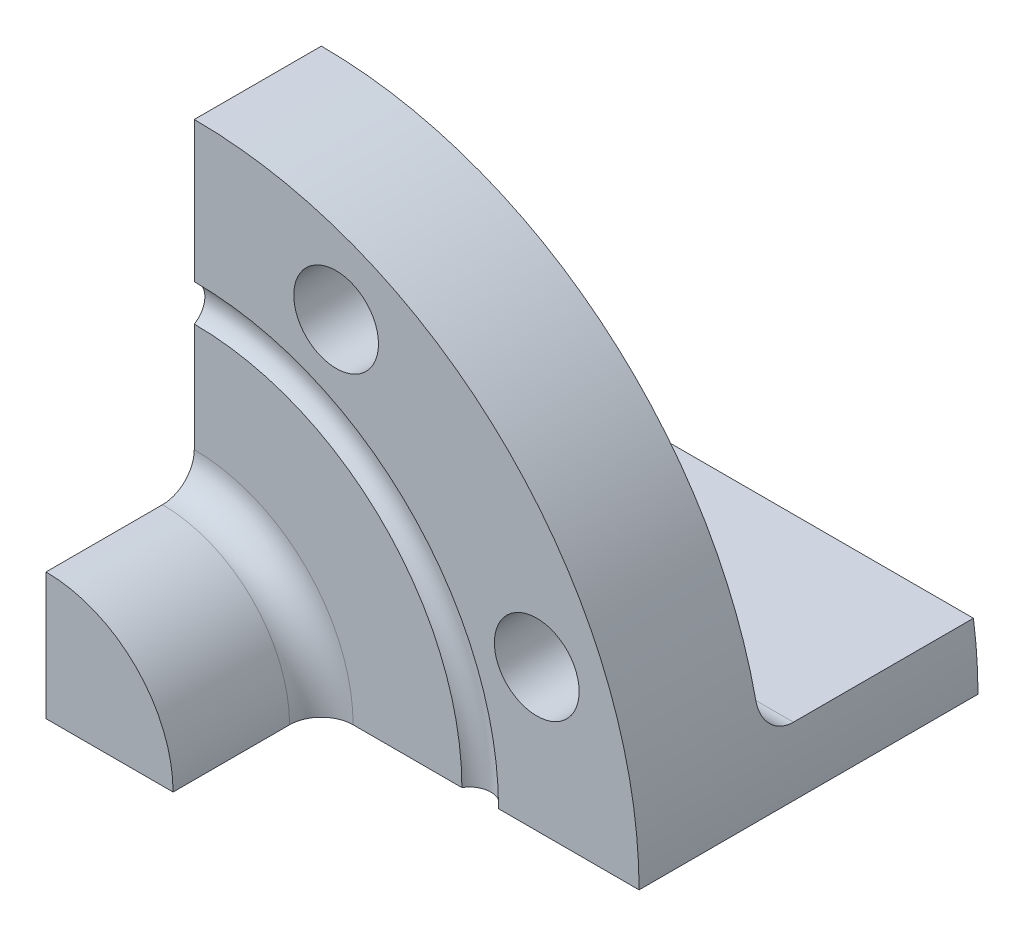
ISO-10303-21;
HEADER;
FILE_DESCRIPTION(('STEP AP214'),'2;1');
FILE_NAME('part.step','',(''),(''),'','','');
FILE_SCHEMA(('AUTOMOTIVE_DESIGN { 1 0 10303 214 1 1 1 1 }'));
ENDSEC;
DATA;
#1=APPLICATION_CONTEXT('core data for automotive mechanical design processes');
#2=APPLICATION_PROTOCOL_DEFINITION('international standard','automotive_design',2000,#1);
#3=PRODUCT_CONTEXT('',#1,'mechanical');
#4=PRODUCT('Part','Part','',(#3));
#5=PRODUCT_RELATED_PRODUCT_CATEGORY('part','',(#4));
#6=PRODUCT_DEFINITION_FORMATION('','',#4);
#7=PRODUCT_DEFINITION_CONTEXT('part definition',#1,'design');
#8=PRODUCT_DEFINITION('design','',#6,#7);
#9=PRODUCT_DEFINITION_SHAPE('','',#8);
#10=(LENGTH_UNIT() NAMED_UNIT(*) SI_UNIT(.MILLI.,.METRE.));
#11=(NAMED_UNIT(*) PLANE_ANGLE_UNIT() SI_UNIT($,.RADIAN.));
#12=(NAMED_UNIT(*) SI_UNIT($,.STERADIAN.) SOLID_ANGLE_UNIT());
#13=UNCERTAINTY_MEASURE_WITH_UNIT(LENGTH_MEASURE(1.E-05),#10,'distance_accuracy_value','');
#14=(GEOMETRIC_REPRESENTATION_CONTEXT(3) GLOBAL_UNCERTAINTY_ASSIGNED_CONTEXT((#13)) GLOBAL_UNIT_ASSIGNED_CONTEXT((#10,
#11,#12)) REPRESENTATION_CONTEXT('',''));
#15=CARTESIAN_POINT('',(0.,0.,0.));
#16=DIRECTION('',(0.,0.,1.));
#17=DIRECTION('',(1.,0.,0.));
#18=AXIS2_PLACEMENT_3D('',#15,#16,#17);
#19=CARTESIAN_POINT('',(0.,42.,-12.));
#20=DIRECTION('',(-1.,0.,0.));
#21=DIRECTION('',(0.,0.,1.));
#22=AXIS2_PLACEMENT_3D('',#19,#20,#21);
#23=PLANE('',#22);
#24=DIRECTION('',(0.,-1.,0.));
#25=VECTOR('',#24,1.);
#26=CARTESIAN_POINT('',(0.,42.,0.));
#27=LINE('',#26,#25);
#28=CARTESIAN_POINT('',(0.,25.2679491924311,0.));
#29=VERTEX_POINT('',#28);
#30=CARTESIAN_POINT('',(0.,15.,0.));
#31=VERTEX_POINT('',#30);
#32=EDGE_CURVE('E215',#29,#31,#27,.T.);
#33=ORIENTED_EDGE('',*,*,#32,.F.);
#34=CARTESIAN_POINT('',(0.,27.,1.));
#35=DIRECTION('',(-1.,0.,0.));
#36=DIRECTION('',(0.,0.,1.));
#37=AXIS2_PLACEMENT_3D('',#34,#35,#36);
#38=CIRCLE('',#37,2.);
#39=CARTESIAN_POINT('',(0.,28.7320508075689,0.));
#40=VERTEX_POINT('',#39);
#41=EDGE_CURVE('E51',#29,#40,#38,.F.);
#42=ORIENTED_EDGE('',*,*,#41,.T.);
#43=CARTESIAN_POINT('',(0.,42.,0.));
#44=VERTEX_POINT('',#43);
#45=EDGE_CURVE('E150',#44,#40,#27,.T.);
#46=ORIENTED_EDGE('',*,*,#45,.F.);
#47=DIRECTION('',(0.,0.,1.));
#48=VECTOR('',#47,1.);
#49=CARTESIAN_POINT('',(0.,42.,-12.));
#50=LINE('',#49,#48);
#51=CARTESIAN_POINT('',(0.,42.,-12.));
#52=VERTEX_POINT('',#51);
#53=EDGE_CURVE('E154',#52,#44,#50,.T.);
#54=ORIENTED_EDGE('',*,*,#53,.F.);
#55=DIRECTION('',(0.,-1.,0.));
#56=VECTOR('',#55,1.);
#57=CARTESIAN_POINT('',(0.,42.,-12.));
#58=LINE('',#57,#56);
#59=CARTESIAN_POINT('',(0.,9.00000000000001,-12.));
#60=VERTEX_POINT('',#59);
#61=EDGE_CURVE('E148',#52,#60,#58,.T.);
#62=ORIENTED_EDGE('',*,*,#61,.T.);
#63=CARTESIAN_POINT('',(0.,9.,-15.));
#64=DIRECTION('',(-1.,0.,0.));
#65=DIRECTION('',(0.,0.,1.));
#66=AXIS2_PLACEMENT_3D('',#63,#64,#65);
#67=CIRCLE('',#66,3.);
#68=CARTESIAN_POINT('',(0.,6.,-15.));
#69=VERTEX_POINT('',#68);
#70=EDGE_CURVE('E132',#60,#69,#67,.F.);
#71=ORIENTED_EDGE('',*,*,#70,.T.);
#72=DIRECTION('',(0.,1.,0.));
#73=VECTOR('',#72,1.);
#74=CARTESIAN_POINT('',(0.,-10.,-15.));
#75=LINE('',#74,#73);
#76=CARTESIAN_POINT('',(0.,0.,-15.));
#77=VERTEX_POINT('',#76);
#78=EDGE_CURVE('E241',#77,#69,#75,.T.);
#79=ORIENTED_EDGE('',*,*,#78,.F.);
#80=DIRECTION('',(0.,0.,1.));
#81=VECTOR('',#80,1.);
#82=CARTESIAN_POINT('',(0.,0.,-12.));
#83=LINE('',#82,#81);
#84=CARTESIAN_POINT('',(0.,0.,14.));
#85=VERTEX_POINT('',#84);
#86=EDGE_CURVE('E161',#77,#85,#83,.T.);
#87=ORIENTED_EDGE('',*,*,#86,.T.);
#88=DIRECTION('',(0.,-1.,0.));
#89=VECTOR('',#88,1.);
#90=CARTESIAN_POINT('',(0.,12.,14.));
#91=LINE('',#90,#89);
#92=CARTESIAN_POINT('',(0.,12.,14.));
#93=VERTEX_POINT('',#92);
#94=EDGE_CURVE('E239',#93,#85,#91,.T.);
#95=ORIENTED_EDGE('',*,*,#94,.F.);
#96=DIRECTION('',(0.,0.,1.));
#97=VECTOR('',#96,1.);
#98=CARTESIAN_POINT('',(0.,12.,-2.));
#99=LINE('',#98,#97);
#100=CARTESIAN_POINT('',(0.,12.,3.));
#101=VERTEX_POINT('',#100);
#102=EDGE_CURVE('E259',#101,#93,#99,.T.);
#103=ORIENTED_EDGE('',*,*,#102,.F.);
#104=CARTESIAN_POINT('',(0.,15.,3.));
#105=DIRECTION('',(-1.,0.,0.));
#106=DIRECTION('',(0.,0.,1.));
#107=AXIS2_PLACEMENT_3D('',#104,#105,#106);
#108=CIRCLE('',#107,3.);
#109=EDGE_CURVE('E167',#101,#31,#108,.F.);
#110=ORIENTED_EDGE('',*,*,#109,.T.);
#111=EDGE_LOOP('',(#33,#42,#46,#54,#62,#71,#79,#87,#95,#103,#110));
#112=FACE_BOUND('',#111,.T.);
#113=ADVANCED_FACE('F36',(#112),#23,.T.);
#114=CARTESIAN_POINT('',(0.,0.,-12.));
#115=DIRECTION('',(0.,-1.,0.));
#116=DIRECTION('',(0.,0.,-1.));
#117=AXIS2_PLACEMENT_3D('',#114,#115,#116);
#118=PLANE('',#117);
#119=DIRECTION('',(1.,0.,0.));
#120=VECTOR('',#119,1.);
#121=CARTESIAN_POINT('',(0.,0.,0.));
#122=LINE('',#121,#120);
#123=CARTESIAN_POINT('',(28.7320508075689,0.,0.));
#124=VERTEX_POINT('',#123);
#125=CARTESIAN_POINT('',(42.,0.,0.));
#126=VERTEX_POINT('',#125);
#127=EDGE_CURVE('E139',#124,#126,#122,.T.);
#128=ORIENTED_EDGE('',*,*,#127,.F.);
#129=CARTESIAN_POINT('',(27.,0.,1.));
#130=DIRECTION('',(0.,-1.,0.));
#131=DIRECTION('',(0.,0.,-1.));
#132=AXIS2_PLACEMENT_3D('',#129,#130,#131);
#133=CIRCLE('',#132,2.);
#134=CARTESIAN_POINT('',(25.2679491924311,0.,0.));
#135=VERTEX_POINT('',#134);
#136=EDGE_CURVE('E127',#124,#135,#133,.F.);
#137=ORIENTED_EDGE('',*,*,#136,.T.);
#138=CARTESIAN_POINT('',(15.,0.,0.));
#139=VERTEX_POINT('',#138);
#140=EDGE_CURVE('E137',#139,#135,#122,.T.);
#141=ORIENTED_EDGE('',*,*,#140,.F.);
#142=CARTESIAN_POINT('',(15.,0.,3.));
#143=DIRECTION('',(0.,-1.,0.));
#144=DIRECTION('',(0.,0.,-1.));
#145=AXIS2_PLACEMENT_3D('',#142,#143,#144);
#146=CIRCLE('',#145,3.);
#147=CARTESIAN_POINT('',(12.,0.,3.));
#148=VERTEX_POINT('',#147);
#149=EDGE_CURVE('E165',#139,#148,#146,.F.);
#150=ORIENTED_EDGE('',*,*,#149,.T.);
#151=DIRECTION('',(0.,0.,1.));
#152=VECTOR('',#151,1.);
#153=CARTESIAN_POINT('',(12.,0.,-2.));
#154=LINE('',#153,#152);
#155=CARTESIAN_POINT('',(12.,0.,14.));
#156=VERTEX_POINT('',#155);
#157=EDGE_CURVE('E249',#148,#156,#154,.T.);
#158=ORIENTED_EDGE('',*,*,#157,.T.);
#159=DIRECTION('',(1.,0.,0.));
#160=VECTOR('',#159,1.);
#161=CARTESIAN_POINT('',(0.,0.,14.));
#162=LINE('',#161,#160);
#163=EDGE_CURVE('E246',#85,#156,#162,.T.);
#164=ORIENTED_EDGE('',*,*,#163,.F.);
#165=ORIENTED_EDGE('',*,*,#86,.F.);
#166=CARTESIAN_POINT('',(0.,0.,-22.));
#167=DIRECTION('',(0.,-1.,0.));
#168=DIRECTION('',(0.,0.,-1.));
#169=AXIS2_PLACEMENT_3D('',#166,#167,#168);
#170=CIRCLE('',#169,7.);
#171=CARTESIAN_POINT('',(0.,0.,-29.));
#172=VERTEX_POINT('',#171);
#173=EDGE_CURVE('E283',#172,#77,#170,.T.);
#174=ORIENTED_EDGE('',*,*,#173,.F.);
#175=CARTESIAN_POINT('',(0.,0.,-32.));
#176=VERTEX_POINT('',#175);
#177=EDGE_CURVE('E158',#176,#172,#83,.T.);
#178=ORIENTED_EDGE('',*,*,#177,.F.);
#179=DIRECTION('',(-1.,0.,0.));
#180=VECTOR('',#179,1.);
#181=CARTESIAN_POINT('',(42.,0.,-32.));
#182=LINE('',#181,#180);
#183=CARTESIAN_POINT('',(42.,0.,-32.));
#184=VERTEX_POINT('',#183);
#185=EDGE_CURVE('E303',#184,#176,#182,.T.);
#186=ORIENTED_EDGE('',*,*,#185,.F.);
#187=DIRECTION('',(0.,0.,1.));
#188=VECTOR('',#187,1.);
#189=CARTESIAN_POINT('',(42.,0.,-12.));
#190=LINE('',#189,#188);
#191=EDGE_CURVE('E156',#184,#126,#190,.T.);
#192=ORIENTED_EDGE('',*,*,#191,.T.);
#193=EDGE_LOOP('',(#128,#137,#141,#150,#158,#164,#165,#174,#178,#186,#192));
#194=FACE_BOUND('',#193,.T.);
#195=ADVANCED_FACE('F136',(#194),#118,.T.);
#196=CARTESIAN_POINT('',(0.,0.,0.));
#197=DIRECTION('',(0.,0.,-1.));
#198=DIRECTION('',(-1.,0.,0.));
#199=AXIS2_PLACEMENT_3D('',#196,#197,#198);
#200=PLANE('',#199);
#201=CARTESIAN_POINT('',(13.3939201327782,32.335783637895,0.));
#202=DIRECTION('',(0.,0.,1.));
#203=DIRECTION('',(1.,0.,0.));
#204=AXIS2_PLACEMENT_3D('',#201,#202,#203);
#205=CIRCLE('',#204,4.);
#206=CARTESIAN_POINT('',(17.3939201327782,32.335783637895,0.));
#207=VERTEX_POINT('',#206);
#208=EDGE_CURVE('E221',#207,#207,#205,.T.);
#209=ORIENTED_EDGE('',*,*,#208,.F.);
#210=EDGE_LOOP('',(#209));
#211=FACE_BOUND('',#210,.T.);
#212=CARTESIAN_POINT('',(32.335783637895,13.3939201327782,0.));
#213=DIRECTION('',(0.,0.,1.));
#214=DIRECTION('',(1.,0.,0.));
#215=AXIS2_PLACEMENT_3D('',#212,#213,#214);
#216=CIRCLE('',#215,4.00000000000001);
#217=CARTESIAN_POINT('',(36.335783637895,13.3939201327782,0.));
#218=VERTEX_POINT('',#217);
#219=EDGE_CURVE('E229',#218,#218,#216,.T.);
#220=ORIENTED_EDGE('',*,*,#219,.F.);
#221=EDGE_LOOP('',(#220));
#222=FACE_BOUND('',#221,.T.);
#223=CARTESIAN_POINT('',(0.,0.,0.));
#224=DIRECTION('',(0.,0.,-1.));
#225=DIRECTION('',(-1.,0.,0.));
#226=AXIS2_PLACEMENT_3D('',#223,#224,#225);
#227=CIRCLE('',#226,28.7320508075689);
#228=EDGE_CURVE('E11',#124,#40,#227,.F.);
#229=ORIENTED_EDGE('',*,*,#228,.F.);
#230=ORIENTED_EDGE('',*,*,#127,.T.);
#231=CARTESIAN_POINT('',(0.,0.,0.));
#232=DIRECTION('',(0.,0.,1.));
#233=DIRECTION('',(-1.,0.,0.));
#234=AXIS2_PLACEMENT_3D('',#231,#232,#233);
#235=CIRCLE('',#234,42.);
#236=EDGE_CURVE('E145',#126,#44,#235,.T.);
#237=ORIENTED_EDGE('',*,*,#236,.T.);
#238=ORIENTED_EDGE('',*,*,#45,.T.);
#239=EDGE_LOOP('',(#229,#230,#237,#238));
#240=FACE_BOUND('',#239,.T.);
#241=ADVANCED_FACE('F189',(#211,#222,#240),#200,.F.);
#242=CARTESIAN_POINT('',(0.,0.,0.));
#243=DIRECTION('',(0.,0.,1.));
#244=DIRECTION('',(1.,0.,0.));
#245=AXIS2_PLACEMENT_3D('',#242,#243,#244);
#246=CIRCLE('',#245,25.2679491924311);
#247=EDGE_CURVE('E45',#29,#135,#246,.F.);
#248=ORIENTED_EDGE('',*,*,#247,.F.);
#249=ORIENTED_EDGE('',*,*,#32,.T.);
#250=CARTESIAN_POINT('',(0.,0.,0.));
#251=DIRECTION('',(0.,0.,-1.));
#252=DIRECTION('',(-1.,0.,0.));
#253=AXIS2_PLACEMENT_3D('',#250,#251,#252);
#254=CIRCLE('',#253,15.);
#255=EDGE_CURVE('E144',#31,#139,#254,.T.);
#256=ORIENTED_EDGE('',*,*,#255,.T.);
#257=ORIENTED_EDGE('',*,*,#140,.T.);
#258=EDGE_LOOP('',(#248,#249,#256,#257));
#259=FACE_BOUND('',#258,.T.);
#260=ADVANCED_FACE('F142',(#259),#200,.F.);
#261=DIRECTION('',(0.,1.,0.));
#262=VECTOR('',#261,1.);
#263=CARTESIAN_POINT('',(0.,-10.,-29.));
#264=LINE('',#263,#262);
#265=CARTESIAN_POINT('',(0.,6.,-29.));
#266=VERTEX_POINT('',#265);
#267=EDGE_CURVE('E284',#266,#172,#264,.F.);
#268=ORIENTED_EDGE('',*,*,#267,.F.);
#269=DIRECTION('',(0.,0.,-1.));
#270=VECTOR('',#269,1.);
#271=CARTESIAN_POINT('',(0.,6.,-10.));
#272=LINE('',#271,#270);
#273=CARTESIAN_POINT('',(0.,6.,-32.));
#274=VERTEX_POINT('',#273);
#275=EDGE_CURVE('E255',#266,#274,#272,.T.);
#276=ORIENTED_EDGE('',*,*,#275,.T.);
#277=DIRECTION('',(0.,1.,0.));
#278=VECTOR('',#277,1.);
#279=CARTESIAN_POINT('',(0.,0.,-32.));
#280=LINE('',#279,#278);
#281=EDGE_CURVE('E299',#176,#274,#280,.T.);
#282=ORIENTED_EDGE('',*,*,#281,.F.);
#283=ORIENTED_EDGE('',*,*,#177,.T.);
#284=EDGE_LOOP('',(#268,#276,#282,#283));
#285=FACE_BOUND('',#284,.T.);
#286=ADVANCED_FACE('F188',(#285),#23,.T.);
#287=CARTESIAN_POINT('',(0.,0.,-12.));
#288=DIRECTION('',(0.,0.,1.));
#289=DIRECTION('',(1.,0.,0.));
#290=AXIS2_PLACEMENT_3D('',#287,#288,#289);
#291=CYLINDRICAL_SURFACE('',#290,42.);
#292=DIRECTION('',(0.,0.,-1.));
#293=VECTOR('',#292,1.);
#294=CARTESIAN_POINT('',(41.5692193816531,6.,-10.));
#295=LINE('',#294,#293);
#296=CARTESIAN_POINT('',(41.5692193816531,6.,-15.));
#297=VERTEX_POINT('',#296);
#298=CARTESIAN_POINT('',(41.5692193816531,6.,-32.));
#299=VERTEX_POINT('',#298);
#300=EDGE_CURVE('E252',#297,#299,#295,.T.);
#301=ORIENTED_EDGE('',*,*,#300,.F.);
#302=CARTESIAN_POINT('',(41.5692193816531,6.,-15.));
#303=CARTESIAN_POINT('',(41.5692187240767,5.99999148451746,-14.9163466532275));
#304=CARTESIAN_POINT('',(41.5687143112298,6.00349888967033,-14.8326972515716));
#305=CARTESIAN_POINT('',(41.5666937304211,6.01747984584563,-14.66599972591));
#306=CARTESIAN_POINT('',(41.5651776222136,6.02795298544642,-14.5829515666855));
#307=CARTESIAN_POINT('',(41.5611313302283,6.05578650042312,-14.4181182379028));
#308=CARTESIAN_POINT('',(41.5586021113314,6.07314032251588,-14.3363319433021));
#309=CARTESIAN_POINT('',(41.552524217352,6.11458630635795,-14.1745480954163));
#310=CARTESIAN_POINT('',(41.5489755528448,6.1386783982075,-14.094550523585));
#311=CARTESIAN_POINT('',(41.5367807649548,6.22084883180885,-13.8580202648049));
#312=CARTESIAN_POINT('',(41.5265840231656,6.28883428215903,-13.7048738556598));
#313=CARTESIAN_POINT('',(41.5020002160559,6.44906975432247,-13.4123590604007));
#314=CARTESIAN_POINT('',(41.4876136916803,6.54131664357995,-13.2729888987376));
#315=CARTESIAN_POINT('',(41.4545566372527,6.74764046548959,-13.0113583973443));
#316=CARTESIAN_POINT('',(41.4358737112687,6.86178040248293,-12.8891492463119));
#317=CARTESIAN_POINT('',(41.39429165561,7.10832000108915,-12.6656388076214));
#318=CARTESIAN_POINT('',(41.3713918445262,7.24072261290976,-12.5643409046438));
#319=CARTESIAN_POINT('',(41.3213192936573,7.52123952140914,-12.3844103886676));
#320=CARTESIAN_POINT('',(41.2941072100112,7.6694939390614,-12.3060074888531));
#321=CARTESIAN_POINT('',(41.235935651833,7.9763369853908,-12.175125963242));
#322=CARTESIAN_POINT('',(41.2049770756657,8.13492313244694,-12.1226411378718));
#323=CARTESIAN_POINT('',(41.1491786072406,8.41183589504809,-12.055820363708));
#324=CARTESIAN_POINT('',(41.1251056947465,8.5287718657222,-12.0348777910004));
#325=CARTESIAN_POINT('',(41.0756595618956,8.76383322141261,-12.0069687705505));
#326=CARTESIAN_POINT('',(41.0502884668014,8.88195642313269,-11.9999801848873));
#327=CARTESIAN_POINT('',(41.024382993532,9.,-12.));
#328=B_SPLINE_CURVE_WITH_KNOTS('',3,(#302,#303,#304,#305,#306,#307,#308,#309,#310,#311,#312,
#313,#314,#315,#316,#317,#318,#319,#320,#321,#322,#323,#324,#325,#326,#327),.UNSPECIFIED.,.F.,
.F.,(4,2,2,2,2,2,2,2,2,2,2,2,4),(0.,0.250877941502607,0.501741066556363,0.75236583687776,
1.00298800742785,1.50400339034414,2.004954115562,2.50736872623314,3.00986459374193,
3.51724137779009,4.02449673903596,4.38735193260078,4.74963099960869),.UNSPECIFIED.);
#329=CARTESIAN_POINT('',(41.024382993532,9.,-12.));
#330=VERTEX_POINT('',#329);
#331=EDGE_CURVE('E59',#297,#330,#328,.T.);
#332=ORIENTED_EDGE('',*,*,#331,.T.);
#333=CARTESIAN_POINT('',(0.,0.,-12.));
#334=DIRECTION('',(0.,0.,1.));
#335=DIRECTION('',(-1.,0.,0.));
#336=AXIS2_PLACEMENT_3D('',#333,#334,#335);
#337=CIRCLE('',#336,42.);
#338=EDGE_CURVE('E233',#330,#52,#337,.T.);
#339=ORIENTED_EDGE('',*,*,#338,.T.);
#340=ORIENTED_EDGE('',*,*,#53,.T.);
#341=ORIENTED_EDGE('',*,*,#236,.F.);
#342=ORIENTED_EDGE('',*,*,#191,.F.);
#343=CARTESIAN_POINT('',(0.,0.,-32.));
#344=DIRECTION('',(0.,0.,-1.));
#345=DIRECTION('',(-1.,0.,0.));
#346=AXIS2_PLACEMENT_3D('',#343,#344,#345);
#347=CIRCLE('',#346,42.);
#348=EDGE_CURVE('E292',#299,#184,#347,.T.);
#349=ORIENTED_EDGE('',*,*,#348,.F.);
#350=EDGE_LOOP('',(#301,#332,#339,#340,#341,#342,#349));
#351=FACE_BOUND('',#350,.T.);
#352=ADVANCED_FACE('F182',(#351),#291,.T.);
#353=CARTESIAN_POINT('',(0.,0.,-12.));
#354=DIRECTION('',(0.,0.,-1.));
#355=DIRECTION('',(-1.,0.,0.));
#356=AXIS2_PLACEMENT_3D('',#353,#354,#355);
#357=PLANE('',#356);
#358=ORIENTED_EDGE('',*,*,#338,.F.);
#359=DIRECTION('',(1.,0.,0.));
#360=VECTOR('',#359,1.);
#361=CARTESIAN_POINT('',(0.,9.,-12.));
#362=LINE('',#361,#360);
#363=EDGE_CURVE('E175',#330,#60,#362,.F.);
#364=ORIENTED_EDGE('',*,*,#363,.T.);
#365=ORIENTED_EDGE('',*,*,#61,.F.);
#366=EDGE_LOOP('',(#358,#364,#365));
#367=FACE_BOUND('',#366,.T.);
#368=CARTESIAN_POINT('',(32.335783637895,13.3939201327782,-12.));
#369=DIRECTION('',(0.,0.,1.));
#370=DIRECTION('',(1.,0.,0.));
#371=AXIS2_PLACEMENT_3D('',#368,#369,#370);
#372=CIRCLE('',#371,4.00000000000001);
#373=CARTESIAN_POINT('',(36.335783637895,13.3939201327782,-12.));
#374=VERTEX_POINT('',#373);
#375=EDGE_CURVE('E226',#374,#374,#372,.T.);
#376=ORIENTED_EDGE('',*,*,#375,.T.);
#377=EDGE_LOOP('',(#376));
#378=FACE_BOUND('',#377,.T.);
#379=CARTESIAN_POINT('',(13.3939201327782,32.335783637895,-12.));
#380=DIRECTION('',(0.,0.,1.));
#381=DIRECTION('',(1.,0.,0.));
#382=AXIS2_PLACEMENT_3D('',#379,#380,#381);
#383=CIRCLE('',#382,4.);
#384=CARTESIAN_POINT('',(17.3939201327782,32.335783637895,-12.));
#385=VERTEX_POINT('',#384);
#386=EDGE_CURVE('E219',#385,#385,#383,.T.);
#387=ORIENTED_EDGE('',*,*,#386,.T.);
#388=EDGE_LOOP('',(#387));
#389=FACE_BOUND('',#388,.T.);
#390=ADVANCED_FACE('F187',(#367,#378,#389),#357,.T.);
#391=CARTESIAN_POINT('',(13.3939201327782,32.335783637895,-12.));
#392=DIRECTION('',(0.,0.,1.));
#393=DIRECTION('',(1.,0.,0.));
#394=AXIS2_PLACEMENT_3D('',#391,#392,#393);
#395=CYLINDRICAL_SURFACE('',#394,4.);
#396=ORIENTED_EDGE('',*,*,#386,.F.);
#397=EDGE_LOOP('',(#396));
#398=FACE_BOUND('',#397,.T.);
#399=ORIENTED_EDGE('',*,*,#208,.T.);
#400=EDGE_LOOP('',(#399));
#401=FACE_BOUND('',#400,.T.);
#402=ADVANCED_FACE('F320',(#398,#401),#395,.F.);
#403=CARTESIAN_POINT('',(32.335783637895,13.3939201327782,-12.));
#404=DIRECTION('',(0.,0.,1.));
#405=DIRECTION('',(1.,0.,0.));
#406=AXIS2_PLACEMENT_3D('',#403,#404,#405);
#407=CYLINDRICAL_SURFACE('',#406,4.00000000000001);
#408=ORIENTED_EDGE('',*,*,#375,.F.);
#409=EDGE_LOOP('',(#408));
#410=FACE_BOUND('',#409,.T.);
#411=ORIENTED_EDGE('',*,*,#219,.T.);
#412=EDGE_LOOP('',(#411));
#413=FACE_BOUND('',#412,.T.);
#414=ADVANCED_FACE('F267',(#410,#413),#407,.F.);
#415=CARTESIAN_POINT('',(0.,0.,-2.));
#416=DIRECTION('',(0.,0.,1.));
#417=DIRECTION('',(1.,0.,0.));
#418=AXIS2_PLACEMENT_3D('',#415,#416,#417);
#419=CYLINDRICAL_SURFACE('',#418,12.);
#420=ORIENTED_EDGE('',*,*,#157,.F.);
#421=CARTESIAN_POINT('',(0.,0.,3.));
#422=DIRECTION('',(0.,0.,-1.));
#423=DIRECTION('',(-1.,0.,0.));
#424=AXIS2_PLACEMENT_3D('',#421,#422,#423);
#425=CIRCLE('',#424,12.);
#426=EDGE_CURVE('E163',#148,#101,#425,.F.);
#427=ORIENTED_EDGE('',*,*,#426,.T.);
#428=ORIENTED_EDGE('',*,*,#102,.T.);
#429=CARTESIAN_POINT('',(0.,0.,14.));
#430=DIRECTION('',(0.,0.,1.));
#431=DIRECTION('',(1.,0.,0.));
#432=AXIS2_PLACEMENT_3D('',#429,#430,#431);
#433=CIRCLE('',#432,12.);
#434=EDGE_CURVE('E248',#156,#93,#433,.T.);
#435=ORIENTED_EDGE('',*,*,#434,.F.);
#436=EDGE_LOOP('',(#420,#427,#428,#435));
#437=FACE_BOUND('',#436,.T.);
#438=ADVANCED_FACE('F207',(#437),#419,.T.);
#439=CARTESIAN_POINT('',(0.,0.,14.));
#440=DIRECTION('',(0.,0.,1.));
#441=DIRECTION('',(1.,0.,0.));
#442=AXIS2_PLACEMENT_3D('',#439,#440,#441);
#443=PLANE('',#442);
#444=ORIENTED_EDGE('',*,*,#163,.T.);
#445=ORIENTED_EDGE('',*,*,#434,.T.);
#446=ORIENTED_EDGE('',*,*,#94,.T.);
#447=EDGE_LOOP('',(#444,#445,#446));
#448=FACE_BOUND('',#447,.T.);
#449=ADVANCED_FACE('F198',(#448),#443,.T.);
#450=CARTESIAN_POINT('',(0.,0.,3.));
#451=DIRECTION('',(0.,0.,-1.));
#452=DIRECTION('',(-1.,0.,0.));
#453=AXIS2_PLACEMENT_3D('',#450,#451,#452);
#454=TOROIDAL_SURFACE('',#453,15.,3.);
#455=ORIENTED_EDGE('',*,*,#109,.F.);
#456=ORIENTED_EDGE('',*,*,#426,.F.);
#457=ORIENTED_EDGE('',*,*,#149,.F.);
#458=ORIENTED_EDGE('',*,*,#255,.F.);
#459=EDGE_LOOP('',(#455,#456,#457,#458));
#460=FACE_BOUND('',#459,.T.);
#461=ADVANCED_FACE('F195',(#460),#454,.F.);
#462=CARTESIAN_POINT('',(41.5692193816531,6.,-10.));
#463=DIRECTION('',(0.,1.,0.));
#464=DIRECTION('',(0.,0.,1.));
#465=AXIS2_PLACEMENT_3D('',#462,#463,#464);
#466=PLANE('',#465);
#467=CARTESIAN_POINT('',(0.,6.,-22.));
#468=DIRECTION('',(0.,1.,0.));
#469=DIRECTION('',(0.,0.,1.));
#470=AXIS2_PLACEMENT_3D('',#467,#468,#469);
#471=CIRCLE('',#470,7.);
#472=EDGE_CURVE('E170',#69,#266,#471,.T.);
#473=ORIENTED_EDGE('',*,*,#472,.F.);
#474=DIRECTION('',(1.,0.,0.));
#475=VECTOR('',#474,1.);
#476=CARTESIAN_POINT('',(41.5692193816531,6.,-15.));
#477=LINE('',#476,#475);
#478=EDGE_CURVE('E172',#69,#297,#477,.T.);
#479=ORIENTED_EDGE('',*,*,#478,.T.);
#480=ORIENTED_EDGE('',*,*,#300,.T.);
#481=DIRECTION('',(1.,0.,0.));
#482=VECTOR('',#481,1.);
#483=CARTESIAN_POINT('',(41.5692193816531,6.,-32.));
#484=LINE('',#483,#482);
#485=EDGE_CURVE('E289',#274,#299,#484,.T.);
#486=ORIENTED_EDGE('',*,*,#485,.F.);
#487=ORIENTED_EDGE('',*,*,#275,.F.);
#488=EDGE_LOOP('',(#473,#479,#480,#486,#487));
#489=FACE_BOUND('',#488,.T.);
#490=ADVANCED_FACE('F197',(#489),#466,.T.);
#491=CARTESIAN_POINT('',(0.,0.,-32.));
#492=DIRECTION('',(0.,0.,-1.));
#493=DIRECTION('',(-1.,0.,0.));
#494=AXIS2_PLACEMENT_3D('',#491,#492,#493);
#495=PLANE('',#494);
#496=ORIENTED_EDGE('',*,*,#185,.T.);
#497=ORIENTED_EDGE('',*,*,#281,.T.);
#498=ORIENTED_EDGE('',*,*,#485,.T.);
#499=ORIENTED_EDGE('',*,*,#348,.T.);
#500=EDGE_LOOP('',(#496,#497,#498,#499));
#501=FACE_BOUND('',#500,.T.);
#502=ADVANCED_FACE('F204',(#501),#495,.T.);
#503=CARTESIAN_POINT('',(0.,-10.,-22.));
#504=DIRECTION('',(0.,1.,0.));
#505=DIRECTION('',(0.,0.,1.));
#506=AXIS2_PLACEMENT_3D('',#503,#504,#505);
#507=CYLINDRICAL_SURFACE('',#506,7.);
#508=ORIENTED_EDGE('',*,*,#173,.T.);
#509=ORIENTED_EDGE('',*,*,#78,.T.);
#510=ORIENTED_EDGE('',*,*,#472,.T.);
#511=ORIENTED_EDGE('',*,*,#267,.T.);
#512=EDGE_LOOP('',(#508,#509,#510,#511));
#513=FACE_BOUND('',#512,.T.);
#514=ADVANCED_FACE('F281',(#513),#507,.F.);
#515=CARTESIAN_POINT('',(41.5692193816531,9.,-15.));
#516=DIRECTION('',(-1.,0.,0.));
#517=DIRECTION('',(0.,0.,1.));
#518=AXIS2_PLACEMENT_3D('',#515,#516,#517);
#519=CYLINDRICAL_SURFACE('',#518,3.);
#520=ORIENTED_EDGE('',*,*,#70,.F.);
#521=ORIENTED_EDGE('',*,*,#363,.F.);
#522=ORIENTED_EDGE('',*,*,#331,.F.);
#523=ORIENTED_EDGE('',*,*,#478,.F.);
#524=EDGE_LOOP('',(#520,#521,#522,#523));
#525=FACE_BOUND('',#524,.T.);
#526=ADVANCED_FACE('F38',(#525),#519,.F.);
#527=CARTESIAN_POINT('',(0.,0.,1.));
#528=DIRECTION('',(0.,0.,1.));
#529=DIRECTION('',(1.,0.,0.));
#530=AXIS2_PLACEMENT_3D('',#527,#528,#529);
#531=TOROIDAL_SURFACE('',#530,27.,2.);
#532=ORIENTED_EDGE('',*,*,#228,.T.);
#533=ORIENTED_EDGE('',*,*,#41,.F.);
#534=ORIENTED_EDGE('',*,*,#247,.T.);
#535=ORIENTED_EDGE('',*,*,#136,.F.);
#536=EDGE_LOOP('',(#532,#533,#534,#535));
#537=FACE_BOUND('',#536,.T.);
#538=ADVANCED_FACE('F126',(#537),#531,.F.);
#539=CLOSED_SHELL('',(#113,#195,#241,#260,#286,#352,#390,#402,#414,#438,#449,#461,#490,#502,
#514,#526,#538));
#540=MANIFOLD_SOLID_BREP('B2',#539);
#541=ADVANCED_BREP_SHAPE_REPRESENTATION('',(#18,#540),#14);
#542=SHAPE_DEFINITION_REPRESENTATION(#9,#541);
ENDSEC;
END-ISO-10303-21;
